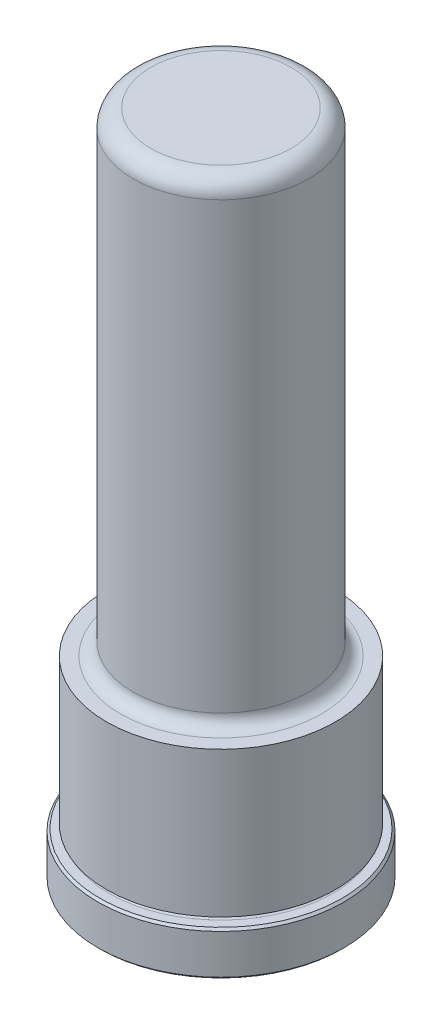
ISO-10303-21;
HEADER;
FILE_DESCRIPTION(('STEP AP214'),'2;1');
FILE_NAME('part.step','',(''),(''),'','','');
FILE_SCHEMA(('AUTOMOTIVE_DESIGN { 1 0 10303 214 1 1 1 1 }'));
ENDSEC;
DATA;
#1=APPLICATION_CONTEXT('core data for automotive mechanical design processes');
#2=APPLICATION_PROTOCOL_DEFINITION('international standard','automotive_design',2000,#1);
#3=PRODUCT_CONTEXT('',#1,'mechanical');
#4=PRODUCT('Part','Part','',(#3));
#5=PRODUCT_RELATED_PRODUCT_CATEGORY('part','',(#4));
#6=PRODUCT_DEFINITION_FORMATION('','',#4);
#7=PRODUCT_DEFINITION_CONTEXT('part definition',#1,'design');
#8=PRODUCT_DEFINITION('design','',#6,#7);
#9=PRODUCT_DEFINITION_SHAPE('','',#8);
#10=(LENGTH_UNIT() NAMED_UNIT(*) SI_UNIT(.MILLI.,.METRE.));
#11=(NAMED_UNIT(*) PLANE_ANGLE_UNIT() SI_UNIT($,.RADIAN.));
#12=(NAMED_UNIT(*) SI_UNIT($,.STERADIAN.) SOLID_ANGLE_UNIT());
#13=UNCERTAINTY_MEASURE_WITH_UNIT(LENGTH_MEASURE(1.E-05),#10,'distance_accuracy_value','');
#14=(GEOMETRIC_REPRESENTATION_CONTEXT(3) GLOBAL_UNCERTAINTY_ASSIGNED_CONTEXT((#13)) GLOBAL_UNIT_ASSIGNED_CONTEXT((#10,
#11,#12)) REPRESENTATION_CONTEXT('',''));
#15=CARTESIAN_POINT('',(0.,0.,0.));
#16=DIRECTION('',(0.,0.,1.));
#17=DIRECTION('',(1.,0.,0.));
#18=AXIS2_PLACEMENT_3D('',#15,#16,#17);
#19=CARTESIAN_POINT('',(0.,0.,0.));
#20=DIRECTION('',(0.,1.,0.));
#21=DIRECTION('',(0.,0.,1.));
#22=AXIS2_PLACEMENT_3D('',#19,#20,#21);
#23=PLANE('',#22);
#24=CARTESIAN_POINT('',(0.,0.,0.));
#25=DIRECTION('',(0.,1.,0.));
#26=DIRECTION('',(0.,0.,1.));
#27=AXIS2_PLACEMENT_3D('',#24,#25,#26);
#28=CIRCLE('',#27,21.844);
#29=CARTESIAN_POINT('',(0.,0.,21.844));
#30=VERTEX_POINT('',#29);
#31=EDGE_CURVE('E46',#30,#30,#28,.F.);
#32=ORIENTED_EDGE('',*,*,#31,.T.);
#33=EDGE_LOOP('',(#32));
#34=FACE_BOUND('',#33,.T.);
#35=ADVANCED_FACE('F31',(#34),#23,.F.);
#36=CARTESIAN_POINT('',(0.,0.,0.));
#37=DIRECTION('',(0.,1.,0.));
#38=DIRECTION('',(0.,0.,1.));
#39=AXIS2_PLACEMENT_3D('',#36,#37,#38);
#40=CYLINDRICAL_SURFACE('',#39,22.225);
#41=CARTESIAN_POINT('',(0.,0.381000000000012,0.));
#42=DIRECTION('',(0.,1.,0.));
#43=DIRECTION('',(0.,0.,1.));
#44=AXIS2_PLACEMENT_3D('',#41,#42,#43);
#45=CIRCLE('',#44,22.225);
#46=CARTESIAN_POINT('',(0.,0.381000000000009,22.225));
#47=VERTEX_POINT('',#46);
#48=EDGE_CURVE('E51',#47,#47,#45,.T.);
#49=ORIENTED_EDGE('',*,*,#48,.T.);
#50=EDGE_LOOP('',(#49));
#51=FACE_BOUND('',#50,.T.);
#52=CARTESIAN_POINT('',(0.,7.54380000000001,0.));
#53=DIRECTION('',(0.,-1.,0.));
#54=DIRECTION('',(0.,0.,-1.));
#55=AXIS2_PLACEMENT_3D('',#52,#53,#54);
#56=CIRCLE('',#55,22.225);
#57=CARTESIAN_POINT('',(0.,7.54380000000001,-22.225));
#58=VERTEX_POINT('',#57);
#59=EDGE_CURVE('E54',#58,#58,#56,.T.);
#60=ORIENTED_EDGE('',*,*,#59,.T.);
#61=EDGE_LOOP('',(#60));
#62=FACE_BOUND('',#61,.T.);
#63=ADVANCED_FACE('F110',(#51,#62),#40,.T.);
#64=CARTESIAN_POINT('',(0.,7.9248,-22.225));
#65=DIRECTION('',(0.,-1.,0.));
#66=DIRECTION('',(0.,0.,-1.));
#67=AXIS2_PLACEMENT_3D('',#64,#65,#66);
#68=PLANE('',#67);
#69=CARTESIAN_POINT('',(0.,7.9248,0.));
#70=DIRECTION('',(0.,-1.,0.));
#71=DIRECTION('',(0.,0.,-1.));
#72=AXIS2_PLACEMENT_3D('',#69,#70,#71);
#73=CIRCLE('',#72,21.844);
#74=CARTESIAN_POINT('',(0.,7.9248,-21.844));
#75=VERTEX_POINT('',#74);
#76=EDGE_CURVE('E42',#75,#75,#73,.F.);
#77=ORIENTED_EDGE('',*,*,#76,.T.);
#78=EDGE_LOOP('',(#77));
#79=FACE_BOUND('',#78,.T.);
#80=CARTESIAN_POINT('',(0.,7.9248,0.));
#81=DIRECTION('',(0.,1.,0.));
#82=DIRECTION('',(0.,0.,1.));
#83=AXIS2_PLACEMENT_3D('',#80,#81,#82);
#84=CIRCLE('',#83,20.2438);
#85=CARTESIAN_POINT('',(0.,7.92479999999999,20.2438));
#86=VERTEX_POINT('',#85);
#87=EDGE_CURVE('E57',#86,#86,#84,.T.);
#88=ORIENTED_EDGE('',*,*,#87,.F.);
#89=EDGE_LOOP('',(#88));
#90=FACE_BOUND('',#89,.T.);
#91=ADVANCED_FACE('F105',(#79,#90),#68,.F.);
#92=CARTESIAN_POINT('',(0.,8.3058,0.));
#93=DIRECTION('',(0.,1.,0.));
#94=DIRECTION('',(0.,0.,1.));
#95=AXIS2_PLACEMENT_3D('',#92,#93,#94);
#96=TOROIDAL_SURFACE('',#95,20.2438,0.380999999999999);
#97=CARTESIAN_POINT('',(0.,8.6868,0.));
#98=DIRECTION('',(0.,1.,0.));
#99=DIRECTION('',(0.,0.,1.));
#100=AXIS2_PLACEMENT_3D('',#97,#98,#99);
#101=CIRCLE('',#100,20.2438);
#102=CARTESIAN_POINT('',(0.,8.68679999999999,20.2438));
#103=VERTEX_POINT('',#102);
#104=EDGE_CURVE('E60',#103,#103,#101,.T.);
#105=ORIENTED_EDGE('',*,*,#104,.F.);
#106=EDGE_LOOP('',(#105));
#107=FACE_BOUND('',#106,.T.);
#108=ORIENTED_EDGE('',*,*,#87,.T.);
#109=EDGE_LOOP('',(#108));
#110=FACE_BOUND('',#109,.T.);
#111=ADVANCED_FACE('F99',(#107,#110),#96,.F.);
#112=CARTESIAN_POINT('',(0.,8.6868,-20.2438));
#113=DIRECTION('',(0.,1.,0.));
#114=DIRECTION('',(0.,0.,1.));
#115=AXIS2_PLACEMENT_3D('',#112,#113,#114);
#116=PLANE('',#115);
#117=CARTESIAN_POINT('',(0.,8.6868,0.));
#118=DIRECTION('',(0.,1.,0.));
#119=DIRECTION('',(0.,0.,1.));
#120=AXIS2_PLACEMENT_3D('',#117,#118,#119);
#121=CIRCLE('',#120,20.6502);
#122=CARTESIAN_POINT('',(0.,8.6868,20.6502));
#123=VERTEX_POINT('',#122);
#124=EDGE_CURVE('E63',#123,#123,#121,.T.);
#125=ORIENTED_EDGE('',*,*,#124,.F.);
#126=EDGE_LOOP('',(#125));
#127=FACE_BOUND('',#126,.T.);
#128=ORIENTED_EDGE('',*,*,#104,.T.);
#129=EDGE_LOOP('',(#128));
#130=FACE_BOUND('',#129,.T.);
#131=ADVANCED_FACE('F93',(#127,#130),#116,.F.);
#132=CARTESIAN_POINT('',(0.,0.,0.));
#133=DIRECTION('',(0.,1.,0.));
#134=DIRECTION('',(0.,0.,1.));
#135=AXIS2_PLACEMENT_3D('',#132,#133,#134);
#136=CYLINDRICAL_SURFACE('',#135,20.6502);
#137=CARTESIAN_POINT('',(0.,34.925,0.));
#138=DIRECTION('',(0.,1.,0.));
#139=DIRECTION('',(0.,0.,1.));
#140=AXIS2_PLACEMENT_3D('',#137,#138,#139);
#141=CIRCLE('',#140,20.6502);
#142=CARTESIAN_POINT('',(0.,34.925,20.6502));
#143=VERTEX_POINT('',#142);
#144=EDGE_CURVE('E66',#143,#143,#141,.T.);
#145=ORIENTED_EDGE('',*,*,#144,.F.);
#146=EDGE_LOOP('',(#145));
#147=FACE_BOUND('',#146,.T.);
#148=ORIENTED_EDGE('',*,*,#124,.T.);
#149=EDGE_LOOP('',(#148));
#150=FACE_BOUND('',#149,.T.);
#151=ADVANCED_FACE('F87',(#147,#150),#136,.T.);
#152=CARTESIAN_POINT('',(0.,34.925,-20.6502));
#153=DIRECTION('',(0.,-1.,0.));
#154=DIRECTION('',(0.,0.,-1.));
#155=AXIS2_PLACEMENT_3D('',#152,#153,#154);
#156=PLANE('',#155);
#157=CARTESIAN_POINT('',(0.,34.925,0.));
#158=DIRECTION('',(0.,1.,0.));
#159=DIRECTION('',(0.,0.,1.));
#160=AXIS2_PLACEMENT_3D('',#157,#158,#159);
#161=CIRCLE('',#160,18.1483);
#162=CARTESIAN_POINT('',(0.,34.925,18.1483));
#163=VERTEX_POINT('',#162);
#164=EDGE_CURVE('E69',#163,#163,#161,.T.);
#165=ORIENTED_EDGE('',*,*,#164,.F.);
#166=EDGE_LOOP('',(#165));
#167=FACE_BOUND('',#166,.T.);
#168=ORIENTED_EDGE('',*,*,#144,.T.);
#169=EDGE_LOOP('',(#168));
#170=FACE_BOUND('',#169,.T.);
#171=ADVANCED_FACE('F81',(#167,#170),#156,.F.);
#172=CARTESIAN_POINT('',(0.,37.211,0.));
#173=DIRECTION('',(0.,1.,0.));
#174=DIRECTION('',(0.,0.,1.));
#175=AXIS2_PLACEMENT_3D('',#172,#173,#174);
#176=TOROIDAL_SURFACE('',#175,18.1483,2.28599999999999);
#177=CARTESIAN_POINT('',(0.,37.211,0.));
#178=DIRECTION('',(0.,1.,0.));
#179=DIRECTION('',(0.,0.,1.));
#180=AXIS2_PLACEMENT_3D('',#177,#178,#179);
#181=CIRCLE('',#180,15.8623);
#182=CARTESIAN_POINT('',(0.,37.211,15.8623));
#183=VERTEX_POINT('',#182);
#184=EDGE_CURVE('E72',#183,#183,#181,.T.);
#185=ORIENTED_EDGE('',*,*,#184,.F.);
#186=EDGE_LOOP('',(#185));
#187=FACE_BOUND('',#186,.T.);
#188=ORIENTED_EDGE('',*,*,#164,.T.);
#189=EDGE_LOOP('',(#188));
#190=FACE_BOUND('',#189,.T.);
#191=ADVANCED_FACE('F78',(#187,#190),#176,.F.);
#192=CARTESIAN_POINT('',(0.,0.,0.));
#193=DIRECTION('',(0.,1.,0.));
#194=DIRECTION('',(0.,0.,1.));
#195=AXIS2_PLACEMENT_3D('',#192,#193,#194);
#196=CYLINDRICAL_SURFACE('',#195,15.8623);
#197=CARTESIAN_POINT('',(0.,117.475,0.));
#198=DIRECTION('',(0.,-1.,0.));
#199=DIRECTION('',(0.,0.,-1.));
#200=AXIS2_PLACEMENT_3D('',#197,#198,#199);
#201=CIRCLE('',#200,15.8623);
#202=CARTESIAN_POINT('',(0.,117.475,-15.8623));
#203=VERTEX_POINT('',#202);
#204=EDGE_CURVE('E10',#203,#203,#201,.T.);
#205=ORIENTED_EDGE('',*,*,#204,.T.);
#206=EDGE_LOOP('',(#205));
#207=FACE_BOUND('',#206,.T.);
#208=ORIENTED_EDGE('',*,*,#184,.T.);
#209=EDGE_LOOP('',(#208));
#210=FACE_BOUND('',#209,.T.);
#211=ADVANCED_FACE('F76',(#207,#210),#196,.T.);
#212=CARTESIAN_POINT('',(0.,120.65,-15.8623));
#213=DIRECTION('',(0.,-1.,0.));
#214=DIRECTION('',(0.,0.,-1.));
#215=AXIS2_PLACEMENT_3D('',#212,#213,#214);
#216=PLANE('',#215);
#217=CARTESIAN_POINT('',(0.,120.65,0.));
#218=DIRECTION('',(0.,-1.,0.));
#219=DIRECTION('',(0.,0.,-1.));
#220=AXIS2_PLACEMENT_3D('',#217,#218,#219);
#221=CIRCLE('',#220,12.6873);
#222=CARTESIAN_POINT('',(0.,120.65,-12.6873));
#223=VERTEX_POINT('',#222);
#224=EDGE_CURVE('E38',#223,#223,#221,.F.);
#225=ORIENTED_EDGE('',*,*,#224,.T.);
#226=EDGE_LOOP('',(#225));
#227=FACE_BOUND('',#226,.T.);
#228=ADVANCED_FACE('F127',(#227),#216,.F.);
#229=CARTESIAN_POINT('',(0.,0.381000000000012,0.));
#230=DIRECTION('',(0.,1.,0.));
#231=DIRECTION('',(0.,0.,1.));
#232=AXIS2_PLACEMENT_3D('',#229,#230,#231);
#233=CONICAL_SURFACE('',#232,22.225,0.785398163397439);
#234=ORIENTED_EDGE('',*,*,#31,.F.);
#235=EDGE_LOOP('',(#234));
#236=FACE_BOUND('',#235,.T.);
#237=ORIENTED_EDGE('',*,*,#48,.F.);
#238=EDGE_LOOP('',(#237));
#239=FACE_BOUND('',#238,.T.);
#240=ADVANCED_FACE('F124',(#236,#239),#233,.T.);
#241=CARTESIAN_POINT('',(0.,7.9248,0.));
#242=DIRECTION('',(0.,-1.,0.));
#243=DIRECTION('',(0.,0.,-1.));
#244=AXIS2_PLACEMENT_3D('',#241,#242,#243);
#245=CONICAL_SURFACE('',#244,21.844,0.785398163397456);
#246=ORIENTED_EDGE('',*,*,#59,.F.);
#247=EDGE_LOOP('',(#246));
#248=FACE_BOUND('',#247,.T.);
#249=ORIENTED_EDGE('',*,*,#76,.F.);
#250=EDGE_LOOP('',(#249));
#251=FACE_BOUND('',#250,.T.);
#252=ADVANCED_FACE('F126',(#248,#251),#245,.T.);
#253=CARTESIAN_POINT('',(0.,117.475,0.));
#254=DIRECTION('',(0.,-1.,0.));
#255=DIRECTION('',(0.,0.,-1.));
#256=AXIS2_PLACEMENT_3D('',#253,#254,#255);
#257=TOROIDAL_SURFACE('',#256,12.6873,3.175);
#258=ORIENTED_EDGE('',*,*,#204,.F.);
#259=EDGE_LOOP('',(#258));
#260=FACE_BOUND('',#259,.T.);
#261=ORIENTED_EDGE('',*,*,#224,.F.);
#262=EDGE_LOOP('',(#261));
#263=FACE_BOUND('',#262,.T.);
#264=ADVANCED_FACE('F33',(#260,#263),#257,.T.);
#265=CLOSED_SHELL('',(#35,#63,#91,#111,#131,#151,#171,#191,#211,#228,#240,#252,#264));
#266=MANIFOLD_SOLID_BREP('B2',#265);
#267=ADVANCED_BREP_SHAPE_REPRESENTATION('',(#18,#266),#14);
#268=SHAPE_DEFINITION_REPRESENTATION(#9,#267);
ENDSEC;
END-ISO-10303-21;
